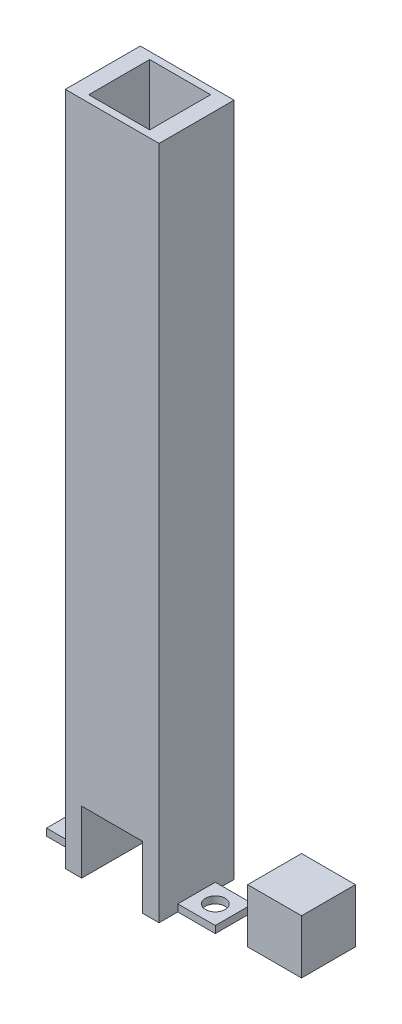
from build123d import *

# Parameters (mm, degrees)
SKETCH1_W           = 11.5
SKETCH1_H           = 11.5
BOSS_EXTRUDE1_DEPTH = 11.5
SKETCH2_W           = 20
SKETCH2_H           = 144
BOSS_EXTRUDE2_DEPTH = 16
SKETCH4_W           = 13
SKETCH4_H           = 13
CUT_EXTRUDE1_DEPTH  = 152.98237065
SKETCH5_W           = 13
SKETCH5_H           = 13.3
CUT_EXTRUDE2_DEPTH  = 1.5
SKETCH6_W           = 13
SKETCH6_H           = 8
CUT_EXTRUDE3_DEPTH  = 1.5
SKETCH7_W           = 8
SKETCH7_H           = 1.5
BOSS_EXTRUDE3_DEPTH = 8
SKETCH8_R           = 2.1
CUT_EXTRUDE4_DEPTH  = 10


with BuildPart() as part:
    # Sketch1 → Boss-Extrude1 (new body)
    with BuildSketch(Plane.XY):
        with Locations((-5.75, -5.75)):
            Rectangle(SKETCH1_W, SKETCH1_H)
    extrude(amount=BOSS_EXTRUDE1_DEPTH)


with BuildPart() as body_2:
    # Sketch2 → Boss-Extrude2 (new body)
    with BuildSketch(Plane.XY):
        with Locations((-35.898158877, 60)):
            Rectangle(SKETCH2_W, SKETCH2_H)
    extrude(amount=BOSS_EXTRUDE2_DEPTH)

    # Sketch4 → Cut-Extrude1 (cut, through all)
    with BuildSketch(Plane(origin=(0, 132, 0), x_dir=(1, 0, 0), z_dir=(0, 1, 0))):
        with Locations((-35.898158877, -8)):
            Rectangle(SKETCH4_W, SKETCH4_H)
    extrude(amount=-CUT_EXTRUDE1_DEPTH, mode=Mode.SUBTRACT)

    # Sketch5 → Cut-Extrude2 (cut)
    with BuildSketch(Plane.XY.offset(16)):
        with Locations((-35.898158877, -5.35)):
            Rectangle(SKETCH5_W, SKETCH5_H)
    extrude(amount=-CUT_EXTRUDE2_DEPTH, mode=Mode.SUBTRACT)

    # Sketch6 → Cut-Extrude3 (cut)
    with BuildSketch(Plane(origin=(0, 0, 0), x_dir=(-1, 0, 0), z_dir=(0, 0, -1))):
        with Locations((35.898158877, -8)):
            Rectangle(SKETCH6_W, SKETCH6_H)
    extrude(amount=-CUT_EXTRUDE3_DEPTH, mode=Mode.SUBTRACT)

    # Sketch7 → Boss-Extrude3 (add)
    with BuildSketch(Plane.ZY.offset(45.898158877)):
        with Locations((8, -11.25)):
            Rectangle(SKETCH7_W, SKETCH7_H)
    boss_extrude3 = extrude(amount=BOSS_EXTRUDE3_DEPTH)

    # Sketch8 → Cut-Extrude4 (cut)
    with BuildSketch(Plane(origin=(0, -10.5, 0), x_dir=(1, 0, 0), z_dir=(0, 1, 0))):
        with Locations(Location((-49.898158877, -8, 0), (0, 0, 270))):
            Circle(SKETCH8_R)
    cut_extrude4 = extrude(amount=-CUT_EXTRUDE4_DEPTH, mode=Mode.SUBTRACT)

    # Mirror3: Boss-Extrude3, Cut-Extrude4 across plane
    add(boss_extrude3.mirror(Plane.ZY.offset(35.898158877)))
    add(cut_extrude4.mirror(Plane.ZY.offset(35.898158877)), mode=Mode.SUBTRACT)


solid = Compound([part.part, body_2.part])
